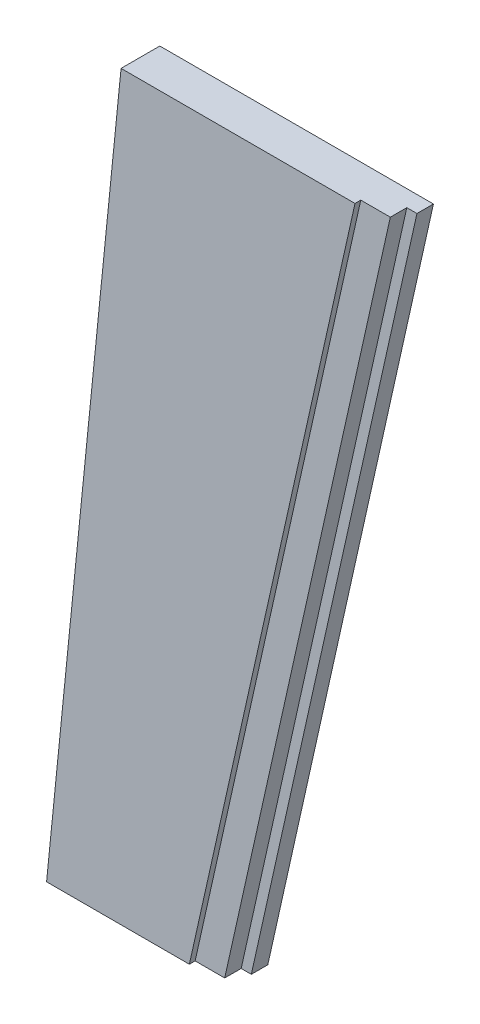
ISO-10303-21;
HEADER;
FILE_DESCRIPTION(('STEP AP214'),'2;1');
FILE_NAME('part.step','',(''),(''),'','','');
FILE_SCHEMA(('AUTOMOTIVE_DESIGN { 1 0 10303 214 1 1 1 1 }'));
ENDSEC;
DATA;
#1=APPLICATION_CONTEXT('core data for automotive mechanical design processes');
#2=APPLICATION_PROTOCOL_DEFINITION('international standard','automotive_design',2000,#1);
#3=PRODUCT_CONTEXT('',#1,'mechanical');
#4=PRODUCT('Part','Part','',(#3));
#5=PRODUCT_RELATED_PRODUCT_CATEGORY('part','',(#4));
#6=PRODUCT_DEFINITION_FORMATION('','',#4);
#7=PRODUCT_DEFINITION_CONTEXT('part definition',#1,'design');
#8=PRODUCT_DEFINITION('design','',#6,#7);
#9=PRODUCT_DEFINITION_SHAPE('','',#8);
#10=(LENGTH_UNIT() NAMED_UNIT(*) SI_UNIT(.MILLI.,.METRE.));
#11=(NAMED_UNIT(*) PLANE_ANGLE_UNIT() SI_UNIT($,.RADIAN.));
#12=(NAMED_UNIT(*) SI_UNIT($,.STERADIAN.) SOLID_ANGLE_UNIT());
#13=UNCERTAINTY_MEASURE_WITH_UNIT(LENGTH_MEASURE(1.E-05),#10,'distance_accuracy_value','');
#14=(GEOMETRIC_REPRESENTATION_CONTEXT(3) GLOBAL_UNCERTAINTY_ASSIGNED_CONTEXT((#13)) GLOBAL_UNIT_ASSIGNED_CONTEXT((#10,
#11,#12)) REPRESENTATION_CONTEXT('',''));
#15=CARTESIAN_POINT('',(0.,0.,0.));
#16=DIRECTION('',(0.,0.,1.));
#17=DIRECTION('',(1.,0.,0.));
#18=AXIS2_PLACEMENT_3D('',#15,#16,#17);
#19=CARTESIAN_POINT('',(-1226.73843653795,-1.50227168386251E-13,47.));
#20=DIRECTION('',(-0.975961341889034,0.217943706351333,0.));
#21=DIRECTION('',(-0.217943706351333,-0.975961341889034,0.));
#22=AXIS2_PLACEMENT_3D('',#19,#20,#21);
#23=PLANE('',#22);
#24=DIRECTION('',(0.,0.,-1.));
#25=VECTOR('',#24,1.);
#26=CARTESIAN_POINT('',(-1427.71907716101,-900.,47.));
#27=LINE('',#26,#25);
#28=CARTESIAN_POINT('',(-1427.71907716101,-900.,47.));
#29=VERTEX_POINT('',#28);
#30=CARTESIAN_POINT('',(-1427.71907716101,-900.,40.));
#31=VERTEX_POINT('',#30);
#32=EDGE_CURVE('E49',#29,#31,#27,.T.);
#33=ORIENTED_EDGE('',*,*,#32,.T.);
#34=DIRECTION('',(0.217943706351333,0.975961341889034,0.));
#35=VECTOR('',#34,1.);
#36=CARTESIAN_POINT('',(-1226.73843653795,-1.50227168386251E-13,40.));
#37=LINE('',#36,#35);
#38=CARTESIAN_POINT('',(-1226.73843653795,-1.50227168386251E-13,40.));
#39=VERTEX_POINT('',#38);
#40=EDGE_CURVE('E45',#31,#39,#37,.T.);
#41=ORIENTED_EDGE('',*,*,#40,.T.);
#42=DIRECTION('',(0.,0.,-1.));
#43=VECTOR('',#42,1.);
#44=CARTESIAN_POINT('',(-1226.73843653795,-1.50227168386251E-13,47.));
#45=LINE('',#44,#43);
#46=CARTESIAN_POINT('',(-1226.73843653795,-1.50227168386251E-13,47.));
#47=VERTEX_POINT('',#46);
#48=EDGE_CURVE('E11',#47,#39,#45,.T.);
#49=ORIENTED_EDGE('',*,*,#48,.F.);
#50=DIRECTION('',(0.217943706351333,0.975961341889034,0.));
#51=VECTOR('',#50,1.);
#52=CARTESIAN_POINT('',(-1226.73843653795,-1.50227168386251E-13,47.));
#53=LINE('',#52,#51);
#54=EDGE_CURVE('E147',#29,#47,#53,.T.);
#55=ORIENTED_EDGE('',*,*,#54,.F.);
#56=EDGE_LOOP('',(#33,#41,#49,#55));
#57=FACE_BOUND('',#56,.T.);
#58=ADVANCED_FACE('F31',(#57),#23,.F.);
#59=CARTESIAN_POINT('',(-1226.73843653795,-1.50227168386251E-13,47.));
#60=DIRECTION('',(0.,-1.,0.));
#61=DIRECTION('',(1.,0.,0.));
#62=AXIS2_PLACEMENT_3D('',#59,#60,#61);
#63=PLANE('',#62);
#64=DIRECTION('',(-1.,0.,0.));
#65=VECTOR('',#64,1.);
#66=CARTESIAN_POINT('',(-1226.73843653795,-1.50227168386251E-13,0.));
#67=LINE('',#66,#65);
#68=CARTESIAN_POINT('',(-1178.58079137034,0.,0.));
#69=VERTEX_POINT('',#68);
#70=CARTESIAN_POINT('',(-1510.6032946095,-1.84989439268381E-13,0.));
#71=VERTEX_POINT('',#70);
#72=EDGE_CURVE('E94',#69,#71,#67,.T.);
#73=ORIENTED_EDGE('',*,*,#72,.T.);
#74=DIRECTION('',(0.,0.,-1.));
#75=VECTOR('',#74,1.);
#76=CARTESIAN_POINT('',(-1510.6032946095,-1.84989439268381E-13,47.));
#77=LINE('',#76,#75);
#78=CARTESIAN_POINT('',(-1510.6032946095,-1.84989439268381E-13,47.));
#79=VERTEX_POINT('',#78);
#80=EDGE_CURVE('E38',#79,#71,#77,.T.);
#81=ORIENTED_EDGE('',*,*,#80,.F.);
#82=DIRECTION('',(-1.,0.,0.));
#83=VECTOR('',#82,1.);
#84=CARTESIAN_POINT('',(-1226.73843653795,-1.50227168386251E-13,47.));
#85=LINE('',#84,#83);
#86=EDGE_CURVE('E150',#47,#79,#85,.T.);
#87=ORIENTED_EDGE('',*,*,#86,.F.);
#88=ORIENTED_EDGE('',*,*,#48,.T.);
#89=DIRECTION('',(1.,0.,0.));
#90=VECTOR('',#89,1.);
#91=CARTESIAN_POINT('',(-1226.73843653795,-1.50227168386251E-13,40.));
#92=LINE('',#91,#90);
#93=CARTESIAN_POINT('',(-1190.8763603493,0.,40.));
#94=VERTEX_POINT('',#93);
#95=EDGE_CURVE('E131',#39,#94,#92,.T.);
#96=ORIENTED_EDGE('',*,*,#95,.T.);
#97=DIRECTION('',(0.,0.,-1.));
#98=VECTOR('',#97,1.);
#99=CARTESIAN_POINT('',(-1190.8763603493,0.,40.));
#100=LINE('',#99,#98);
#101=CARTESIAN_POINT('',(-1190.8763603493,0.,20.));
#102=VERTEX_POINT('',#101);
#103=EDGE_CURVE('E140',#94,#102,#100,.T.);
#104=ORIENTED_EDGE('',*,*,#103,.T.);
#105=DIRECTION('',(1.,0.,0.));
#106=VECTOR('',#105,1.);
#107=CARTESIAN_POINT('',(-1190.8763603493,0.,20.));
#108=LINE('',#107,#106);
#109=CARTESIAN_POINT('',(-1178.58079137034,0.,20.));
#110=VERTEX_POINT('',#109);
#111=EDGE_CURVE('E110',#102,#110,#108,.T.);
#112=ORIENTED_EDGE('',*,*,#111,.T.);
#113=DIRECTION('',(0.,0.,-1.));
#114=VECTOR('',#113,1.);
#115=CARTESIAN_POINT('',(-1178.58079137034,0.,20.));
#116=LINE('',#115,#114);
#117=EDGE_CURVE('E107',#110,#69,#116,.T.);
#118=ORIENTED_EDGE('',*,*,#117,.T.);
#119=EDGE_LOOP('',(#73,#81,#87,#88,#96,#104,#112,#118));
#120=FACE_BOUND('',#119,.T.);
#121=ADVANCED_FACE('F108',(#120),#63,.F.);
#122=CARTESIAN_POINT('',(-1510.6032946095,-1.84989439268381E-13,47.));
#123=DIRECTION('',(0.994993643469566,-0.0999382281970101,0.));
#124=DIRECTION('',(0.0999382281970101,0.994993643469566,0.));
#125=AXIS2_PLACEMENT_3D('',#122,#123,#124);
#126=PLANE('',#125);
#127=DIRECTION('',(-0.0999382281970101,-0.994993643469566,0.));
#128=VECTOR('',#127,1.);
#129=CARTESIAN_POINT('',(-1510.6032946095,-1.84989439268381E-13,0.));
#130=LINE('',#129,#128);
#131=CARTESIAN_POINT('',(-1601.00025942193,-900.000000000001,0.));
#132=VERTEX_POINT('',#131);
#133=EDGE_CURVE('E100',#71,#132,#130,.T.);
#134=ORIENTED_EDGE('',*,*,#133,.T.);
#135=DIRECTION('',(0.,0.,-1.));
#136=VECTOR('',#135,1.);
#137=CARTESIAN_POINT('',(-1601.00025942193,-900.000000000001,47.));
#138=LINE('',#137,#136);
#139=CARTESIAN_POINT('',(-1601.00025942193,-900.000000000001,47.));
#140=VERTEX_POINT('',#139);
#141=EDGE_CURVE('E157',#140,#132,#138,.T.);
#142=ORIENTED_EDGE('',*,*,#141,.F.);
#143=DIRECTION('',(-0.0999382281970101,-0.994993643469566,0.));
#144=VECTOR('',#143,1.);
#145=CARTESIAN_POINT('',(-1510.6032946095,-1.84989439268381E-13,47.));
#146=LINE('',#145,#144);
#147=EDGE_CURVE('E152',#79,#140,#146,.T.);
#148=ORIENTED_EDGE('',*,*,#147,.F.);
#149=ORIENTED_EDGE('',*,*,#80,.T.);
#150=EDGE_LOOP('',(#134,#142,#148,#149));
#151=FACE_BOUND('',#150,.T.);
#152=ADVANCED_FACE('F161',(#151),#126,.F.);
#153=CARTESIAN_POINT('',(-1601.00025942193,-900.000000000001,47.));
#154=DIRECTION('',(0.,1.,0.));
#155=DIRECTION('',(-1.,0.,0.));
#156=AXIS2_PLACEMENT_3D('',#153,#154,#155);
#157=PLANE('',#156);
#158=DIRECTION('',(1.,0.,0.));
#159=VECTOR('',#158,1.);
#160=CARTESIAN_POINT('',(-1601.00025942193,-900.000000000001,0.));
#161=LINE('',#160,#159);
#162=CARTESIAN_POINT('',(-1379.5614319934,-900.,0.));
#163=VERTEX_POINT('',#162);
#164=EDGE_CURVE('E145',#132,#163,#161,.T.);
#165=ORIENTED_EDGE('',*,*,#164,.T.);
#166=DIRECTION('',(0.,0.,-1.));
#167=VECTOR('',#166,1.);
#168=CARTESIAN_POINT('',(-1379.5614319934,-900.,20.));
#169=LINE('',#168,#167);
#170=CARTESIAN_POINT('',(-1379.5614319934,-900.,20.));
#171=VERTEX_POINT('',#170);
#172=EDGE_CURVE('E114',#171,#163,#169,.T.);
#173=ORIENTED_EDGE('',*,*,#172,.F.);
#174=DIRECTION('',(-1.,0.,0.));
#175=VECTOR('',#174,1.);
#176=CARTESIAN_POINT('',(-1391.85700097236,-900.,20.));
#177=LINE('',#176,#175);
#178=CARTESIAN_POINT('',(-1391.85700097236,-900.,20.));
#179=VERTEX_POINT('',#178);
#180=EDGE_CURVE('E115',#171,#179,#177,.T.);
#181=ORIENTED_EDGE('',*,*,#180,.T.);
#182=DIRECTION('',(0.,0.,-1.));
#183=VECTOR('',#182,1.);
#184=CARTESIAN_POINT('',(-1391.85700097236,-900.,40.));
#185=LINE('',#184,#183);
#186=CARTESIAN_POINT('',(-1391.85700097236,-900.,40.));
#187=VERTEX_POINT('',#186);
#188=EDGE_CURVE('E104',#187,#179,#185,.T.);
#189=ORIENTED_EDGE('',*,*,#188,.F.);
#190=DIRECTION('',(-1.,0.,0.));
#191=VECTOR('',#190,1.);
#192=CARTESIAN_POINT('',(-1427.71907716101,-900.,40.));
#193=LINE('',#192,#191);
#194=EDGE_CURVE('E137',#187,#31,#193,.T.);
#195=ORIENTED_EDGE('',*,*,#194,.T.);
#196=ORIENTED_EDGE('',*,*,#32,.F.);
#197=DIRECTION('',(1.,0.,0.));
#198=VECTOR('',#197,1.);
#199=CARTESIAN_POINT('',(-1601.00025942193,-900.000000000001,47.));
#200=LINE('',#199,#198);
#201=EDGE_CURVE('E154',#140,#29,#200,.T.);
#202=ORIENTED_EDGE('',*,*,#201,.F.);
#203=ORIENTED_EDGE('',*,*,#141,.T.);
#204=EDGE_LOOP('',(#165,#173,#181,#189,#195,#196,#202,#203));
#205=FACE_BOUND('',#204,.T.);
#206=ADVANCED_FACE('F174',(#205),#157,.F.);
#207=CARTESIAN_POINT('',(-1226.73843653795,-1.50227168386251E-13,47.));
#208=DIRECTION('',(0.,0.,-1.));
#209=DIRECTION('',(-1.,0.,0.));
#210=AXIS2_PLACEMENT_3D('',#207,#208,#209);
#211=PLANE('',#210);
#212=ORIENTED_EDGE('',*,*,#54,.T.);
#213=ORIENTED_EDGE('',*,*,#86,.T.);
#214=ORIENTED_EDGE('',*,*,#147,.T.);
#215=ORIENTED_EDGE('',*,*,#201,.T.);
#216=EDGE_LOOP('',(#212,#213,#214,#215));
#217=FACE_BOUND('',#216,.T.);
#218=ADVANCED_FACE('F165',(#217),#211,.F.);
#219=CARTESIAN_POINT('',(-1226.73843653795,-1.50227168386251E-13,0.));
#220=DIRECTION('',(0.,0.,-1.));
#221=DIRECTION('',(-1.,0.,0.));
#222=AXIS2_PLACEMENT_3D('',#219,#220,#221);
#223=PLANE('',#222);
#224=ORIENTED_EDGE('',*,*,#72,.F.);
#225=DIRECTION('',(-0.217943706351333,-0.975961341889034,0.));
#226=VECTOR('',#225,1.);
#227=CARTESIAN_POINT('',(-1379.5614319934,-900.,0.));
#228=LINE('',#227,#226);
#229=EDGE_CURVE('E99',#69,#163,#228,.T.);
#230=ORIENTED_EDGE('',*,*,#229,.T.);
#231=ORIENTED_EDGE('',*,*,#164,.F.);
#232=ORIENTED_EDGE('',*,*,#133,.F.);
#233=EDGE_LOOP('',(#224,#230,#231,#232));
#234=FACE_BOUND('',#233,.T.);
#235=ADVANCED_FACE('F96',(#234),#223,.T.);
#236=CARTESIAN_POINT('',(-1391.85700097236,-900.,40.));
#237=DIRECTION('',(0.975961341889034,-0.217943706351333,0.));
#238=DIRECTION('',(0.217943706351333,0.975961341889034,0.));
#239=AXIS2_PLACEMENT_3D('',#236,#237,#238);
#240=PLANE('',#239);
#241=DIRECTION('',(0.217943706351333,0.975961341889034,0.));
#242=VECTOR('',#241,1.);
#243=CARTESIAN_POINT('',(-1190.8763603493,0.,20.));
#244=LINE('',#243,#242);
#245=EDGE_CURVE('E119',#179,#102,#244,.T.);
#246=ORIENTED_EDGE('',*,*,#245,.T.);
#247=ORIENTED_EDGE('',*,*,#103,.F.);
#248=DIRECTION('',(-0.217943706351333,-0.975961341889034,0.));
#249=VECTOR('',#248,1.);
#250=CARTESIAN_POINT('',(-1391.85700097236,-900.,40.));
#251=LINE('',#250,#249);
#252=EDGE_CURVE('E134',#94,#187,#251,.T.);
#253=ORIENTED_EDGE('',*,*,#252,.T.);
#254=ORIENTED_EDGE('',*,*,#188,.T.);
#255=EDGE_LOOP('',(#246,#247,#253,#254));
#256=FACE_BOUND('',#255,.T.);
#257=ADVANCED_FACE('F184',(#256),#240,.T.);
#258=CARTESIAN_POINT('',(-1427.71907716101,-900.,40.));
#259=DIRECTION('',(0.,0.,1.));
#260=DIRECTION('',(1.,0.,0.));
#261=AXIS2_PLACEMENT_3D('',#258,#259,#260);
#262=PLANE('',#261);
#263=ORIENTED_EDGE('',*,*,#40,.F.);
#264=ORIENTED_EDGE('',*,*,#194,.F.);
#265=ORIENTED_EDGE('',*,*,#252,.F.);
#266=ORIENTED_EDGE('',*,*,#95,.F.);
#267=EDGE_LOOP('',(#263,#264,#265,#266));
#268=FACE_BOUND('',#267,.T.);
#269=ADVANCED_FACE('F187',(#268),#262,.T.);
#270=CARTESIAN_POINT('',(-1379.5614319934,-900.,20.));
#271=DIRECTION('',(0.975961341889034,-0.217943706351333,0.));
#272=DIRECTION('',(0.217943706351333,0.975961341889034,0.));
#273=AXIS2_PLACEMENT_3D('',#270,#271,#272);
#274=PLANE('',#273);
#275=ORIENTED_EDGE('',*,*,#229,.F.);
#276=ORIENTED_EDGE('',*,*,#117,.F.);
#277=DIRECTION('',(-0.217943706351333,-0.975961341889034,0.));
#278=VECTOR('',#277,1.);
#279=CARTESIAN_POINT('',(-1379.5614319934,-900.,20.));
#280=LINE('',#279,#278);
#281=EDGE_CURVE('E125',#110,#171,#280,.T.);
#282=ORIENTED_EDGE('',*,*,#281,.T.);
#283=ORIENTED_EDGE('',*,*,#172,.T.);
#284=EDGE_LOOP('',(#275,#276,#282,#283));
#285=FACE_BOUND('',#284,.T.);
#286=ADVANCED_FACE('F118',(#285),#274,.T.);
#287=CARTESIAN_POINT('',(-1391.85700097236,-900.,20.));
#288=DIRECTION('',(0.,0.,1.));
#289=DIRECTION('',(1.,0.,0.));
#290=AXIS2_PLACEMENT_3D('',#287,#288,#289);
#291=PLANE('',#290);
#292=ORIENTED_EDGE('',*,*,#245,.F.);
#293=ORIENTED_EDGE('',*,*,#180,.F.);
#294=ORIENTED_EDGE('',*,*,#281,.F.);
#295=ORIENTED_EDGE('',*,*,#111,.F.);
#296=EDGE_LOOP('',(#292,#293,#294,#295));
#297=FACE_BOUND('',#296,.T.);
#298=ADVANCED_FACE('F194',(#297),#291,.T.);
#299=CLOSED_SHELL('',(#58,#121,#152,#206,#218,#235,#257,#269,#286,#298));
#300=MANIFOLD_SOLID_BREP('B2',#299);
#301=ADVANCED_BREP_SHAPE_REPRESENTATION('',(#18,#300),#14);
#302=SHAPE_DEFINITION_REPRESENTATION(#9,#301);
ENDSEC;
END-ISO-10303-21;
